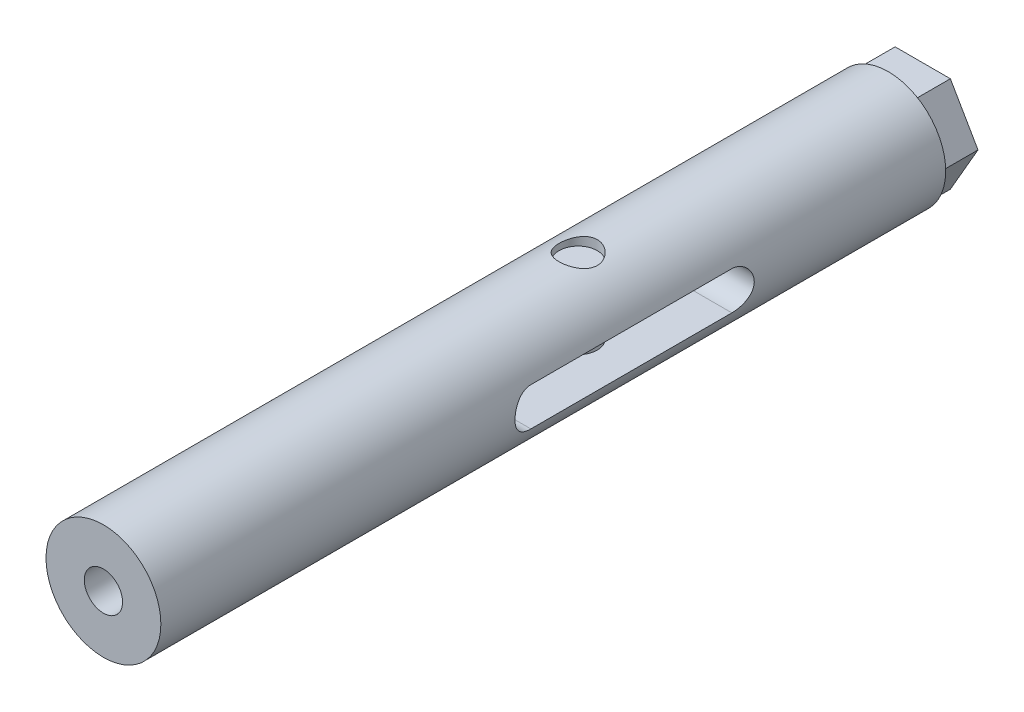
ISO-10303-21;
HEADER;
FILE_DESCRIPTION(('STEP AP214'),'2;1');
FILE_NAME('part.step','',(''),(''),'','','');
FILE_SCHEMA(('AUTOMOTIVE_DESIGN { 1 0 10303 214 1 1 1 1 }'));
ENDSEC;
DATA;
#1=APPLICATION_CONTEXT('core data for automotive mechanical design processes');
#2=APPLICATION_PROTOCOL_DEFINITION('international standard','automotive_design',2000,#1);
#3=PRODUCT_CONTEXT('',#1,'mechanical');
#4=PRODUCT('Part','Part','',(#3));
#5=PRODUCT_RELATED_PRODUCT_CATEGORY('part','',(#4));
#6=PRODUCT_DEFINITION_FORMATION('','',#4);
#7=PRODUCT_DEFINITION_CONTEXT('part definition',#1,'design');
#8=PRODUCT_DEFINITION('design','',#6,#7);
#9=PRODUCT_DEFINITION_SHAPE('','',#8);
#10=(LENGTH_UNIT() NAMED_UNIT(*) SI_UNIT(.MILLI.,.METRE.));
#11=(NAMED_UNIT(*) PLANE_ANGLE_UNIT() SI_UNIT($,.RADIAN.));
#12=(NAMED_UNIT(*) SI_UNIT($,.STERADIAN.) SOLID_ANGLE_UNIT());
#13=UNCERTAINTY_MEASURE_WITH_UNIT(LENGTH_MEASURE(1.E-05),#10,'distance_accuracy_value','');
#14=(GEOMETRIC_REPRESENTATION_CONTEXT(3) GLOBAL_UNCERTAINTY_ASSIGNED_CONTEXT((#13)) GLOBAL_UNIT_ASSIGNED_CONTEXT((#10,
#11,#12)) REPRESENTATION_CONTEXT('',''));
#15=CARTESIAN_POINT('',(0.,0.,0.));
#16=DIRECTION('',(0.,0.,1.));
#17=DIRECTION('',(1.,0.,0.));
#18=AXIS2_PLACEMENT_3D('',#15,#16,#17);
#19=CARTESIAN_POINT('',(0.,5.,36.));
#20=DIRECTION('',(0.,1.,0.));
#21=DIRECTION('',(0.354612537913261,0.,-0.935013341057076));
#22=AXIS2_PLACEMENT_3D('',#19,#20,#21);
#23=PLANE('',#22);
#24=CARTESIAN_POINT('',(0.,5.,36.));
#25=DIRECTION('',(0.,1.,0.));
#26=DIRECTION('',(0.354612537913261,0.,-0.935013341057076));
#27=AXIS2_PLACEMENT_3D('',#24,#25,#26);
#28=CIRCLE('',#27,2.);
#29=CARTESIAN_POINT('',(0.709225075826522,5.,34.1299733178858));
#30=VERTEX_POINT('',#29);
#31=EDGE_CURVE('E306',#30,#30,#28,.T.);
#32=ORIENTED_EDGE('',*,*,#31,.T.);
#33=EDGE_LOOP('',(#32));
#34=FACE_BOUND('',#33,.T.);
#35=ADVANCED_FACE('F14',(#34),#23,.T.);
#36=CARTESIAN_POINT('',(0.,5.,36.));
#37=DIRECTION('',(0.,-1.,0.));
#38=DIRECTION('',(-0.354612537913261,0.,0.935013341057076));
#39=AXIS2_PLACEMENT_3D('',#36,#37,#38);
#40=CYLINDRICAL_SURFACE('',#39,2.);
#41=CARTESIAN_POINT('',(0.,2.,36.));
#42=DIRECTION('',(0.,1.,0.));
#43=DIRECTION('',(1.,0.,0.));
#44=AXIS2_PLACEMENT_3D('',#41,#42,#43);
#45=CIRCLE('',#44,2.);
#46=CARTESIAN_POINT('',(2.,2.,36.));
#47=VERTEX_POINT('',#46);
#48=EDGE_CURVE('E24',#47,#47,#45,.T.);
#49=ORIENTED_EDGE('',*,*,#48,.F.);
#50=EDGE_LOOP('',(#49));
#51=FACE_BOUND('',#50,.T.);
#52=CARTESIAN_POINT('',(0.,-2.,36.));
#53=DIRECTION('',(0.,-1.,0.));
#54=DIRECTION('',(-1.,0.,0.));
#55=AXIS2_PLACEMENT_3D('',#52,#53,#54);
#56=CIRCLE('',#55,2.);
#57=CARTESIAN_POINT('',(-2.,-2.,36.));
#58=VERTEX_POINT('',#57);
#59=EDGE_CURVE('E9',#58,#58,#56,.T.);
#60=ORIENTED_EDGE('',*,*,#59,.F.);
#61=EDGE_LOOP('',(#60));
#62=FACE_BOUND('',#61,.T.);
#63=ADVANCED_FACE('F214',(#51,#62),#40,.T.);
#64=CARTESIAN_POINT('',(0.,-5.,36.));
#65=DIRECTION('',(0.,1.,0.));
#66=DIRECTION('',(0.354612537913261,0.,-0.935013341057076));
#67=AXIS2_PLACEMENT_3D('',#64,#65,#66);
#68=PLANE('',#67);
#69=CARTESIAN_POINT('',(0.,-5.,36.));
#70=DIRECTION('',(0.,1.,0.));
#71=DIRECTION('',(0.354612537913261,0.,-0.935013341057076));
#72=AXIS2_PLACEMENT_3D('',#69,#70,#71);
#73=CIRCLE('',#72,2.);
#74=CARTESIAN_POINT('',(0.709225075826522,-5.,34.1299733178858));
#75=VERTEX_POINT('',#74);
#76=EDGE_CURVE('E283',#75,#75,#73,.T.);
#77=ORIENTED_EDGE('',*,*,#76,.F.);
#78=EDGE_LOOP('',(#77));
#79=FACE_BOUND('',#78,.T.);
#80=ADVANCED_FACE('F202',(#79),#68,.F.);
#81=CARTESIAN_POINT('',(0.,0.,18.6));
#82=DIRECTION('',(0.,0.,-1.));
#83=DIRECTION('',(0.,1.,0.));
#84=AXIS2_PLACEMENT_3D('',#81,#82,#83);
#85=CONICAL_SURFACE('',#84,3.,1.02974425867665);
#86=CARTESIAN_POINT('',(0.,0.,20.4025818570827));
#87=VERTEX_POINT('',#86);
#88=VERTEX_LOOP('',#87);
#89=FACE_BOUND('',#88,.T.);
#90=CARTESIAN_POINT('',(0.,0.,18.6));
#91=DIRECTION('',(0.,0.,-1.));
#92=DIRECTION('',(0.,1.,0.));
#93=AXIS2_PLACEMENT_3D('',#90,#91,#92);
#94=CIRCLE('',#93,3.);
#95=CARTESIAN_POINT('',(0.,3.,18.6));
#96=VERTEX_POINT('',#95);
#97=EDGE_CURVE('E132',#96,#96,#94,.T.);
#98=ORIENTED_EDGE('',*,*,#97,.T.);
#99=EDGE_LOOP('',(#98));
#100=FACE_BOUND('',#99,.T.);
#101=ADVANCED_FACE('F213',(#89,#100),#85,.F.);
#102=CARTESIAN_POINT('',(0.,0.,3.6));
#103=DIRECTION('',(0.,0.,-1.));
#104=DIRECTION('',(0.,1.,0.));
#105=AXIS2_PLACEMENT_3D('',#102,#103,#104);
#106=CYLINDRICAL_SURFACE('',#105,3.);
#107=ORIENTED_EDGE('',*,*,#97,.F.);
#108=EDGE_LOOP('',(#107));
#109=FACE_BOUND('',#108,.T.);
#110=CARTESIAN_POINT('',(0.,0.,0.));
#111=DIRECTION('',(0.,0.,1.));
#112=DIRECTION('',(0.5,-0.866025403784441,0.));
#113=AXIS2_PLACEMENT_3D('',#110,#111,#112);
#114=CIRCLE('',#113,3.);
#115=CARTESIAN_POINT('',(1.5,-2.59807621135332,0.));
#116=VERTEX_POINT('',#115);
#117=EDGE_CURVE('E18',#116,#116,#114,.F.);
#118=ORIENTED_EDGE('',*,*,#117,.T.);
#119=EDGE_LOOP('',(#118));
#120=FACE_BOUND('',#119,.T.);
#121=ADVANCED_FACE('F227',(#109,#120),#106,.F.);
#122=CARTESIAN_POINT('',(-5.5769138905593,-10.3405017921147,0.));
#123=DIRECTION('',(0.,0.,1.));
#124=DIRECTION('',(0.5,-0.866025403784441,0.));
#125=AXIS2_PLACEMENT_3D('',#122,#123,#124);
#126=PLANE('',#125);
#127=DIRECTION('',(0.5,-0.866025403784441,0.));
#128=VECTOR('',#127,1.);
#129=CARTESIAN_POINT('',(5.77350269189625,0.,0.));
#130=LINE('',#129,#128);
#131=CARTESIAN_POINT('',(2.88675134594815,5.,0.));
#132=VERTEX_POINT('',#131);
#133=CARTESIAN_POINT('',(5.77350269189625,0.,0.));
#134=VERTEX_POINT('',#133);
#135=EDGE_CURVE('E54',#132,#134,#130,.T.);
#136=ORIENTED_EDGE('',*,*,#135,.T.);
#137=DIRECTION('',(0.5,0.866025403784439,0.));
#138=VECTOR('',#137,1.);
#139=CARTESIAN_POINT('',(5.77350269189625,0.,0.));
#140=LINE('',#139,#138);
#141=CARTESIAN_POINT('',(2.88675134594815,-5.,0.));
#142=VERTEX_POINT('',#141);
#143=EDGE_CURVE('E278',#142,#134,#140,.T.);
#144=ORIENTED_EDGE('',*,*,#143,.F.);
#145=DIRECTION('',(-1.,0.,0.));
#146=VECTOR('',#145,1.);
#147=CARTESIAN_POINT('',(-2.88675134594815,-5.,0.));
#148=LINE('',#147,#146);
#149=CARTESIAN_POINT('',(-2.88675134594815,-5.,0.));
#150=VERTEX_POINT('',#149);
#151=EDGE_CURVE('E276',#142,#150,#148,.T.);
#152=ORIENTED_EDGE('',*,*,#151,.T.);
#153=DIRECTION('',(0.5,-0.866025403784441,0.));
#154=VECTOR('',#153,1.);
#155=CARTESIAN_POINT('',(-2.88675134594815,-5.,0.));
#156=LINE('',#155,#154);
#157=CARTESIAN_POINT('',(-5.77350269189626,0.,0.));
#158=VERTEX_POINT('',#157);
#159=EDGE_CURVE('E274',#158,#150,#156,.T.);
#160=ORIENTED_EDGE('',*,*,#159,.F.);
#161=DIRECTION('',(-0.5,-0.866025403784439,0.));
#162=VECTOR('',#161,1.);
#163=CARTESIAN_POINT('',(-5.77350269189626,0.,0.));
#164=LINE('',#163,#162);
#165=CARTESIAN_POINT('',(-2.8867513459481,5.,0.));
#166=VERTEX_POINT('',#165);
#167=EDGE_CURVE('E59',#166,#158,#164,.T.);
#168=ORIENTED_EDGE('',*,*,#167,.F.);
#169=DIRECTION('',(1.,0.,0.));
#170=VECTOR('',#169,1.);
#171=CARTESIAN_POINT('',(2.88675134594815,5.,0.));
#172=LINE('',#171,#170);
#173=EDGE_CURVE('E271',#166,#132,#172,.T.);
#174=ORIENTED_EDGE('',*,*,#173,.T.);
#175=EDGE_LOOP('',(#136,#144,#152,#160,#168,#174));
#176=FACE_BOUND('',#175,.T.);
#177=ORIENTED_EDGE('',*,*,#117,.F.);
#178=EDGE_LOOP('',(#177));
#179=FACE_BOUND('',#178,.T.);
#180=ADVANCED_FACE('F223',(#176,#179),#126,.F.);
#181=CARTESIAN_POINT('',(-2.88675134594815,-5.,-1.4));
#182=DIRECTION('',(0.,-1.,0.));
#183=DIRECTION('',(-1.,0.,0.));
#184=AXIS2_PLACEMENT_3D('',#181,#182,#183);
#185=PLANE('',#184);
#186=ORIENTED_EDGE('',*,*,#151,.F.);
#187=DIRECTION('',(0.,0.,1.));
#188=VECTOR('',#187,1.);
#189=CARTESIAN_POINT('',(2.88675134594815,-5.,-1.4));
#190=LINE('',#189,#188);
#191=CARTESIAN_POINT('',(2.88675134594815,-5.,3.6));
#192=VERTEX_POINT('',#191);
#193=EDGE_CURVE('E123',#142,#192,#190,.T.);
#194=ORIENTED_EDGE('',*,*,#193,.T.);
#195=DIRECTION('',(1.,0.,0.));
#196=VECTOR('',#195,1.);
#197=CARTESIAN_POINT('',(-2.88675134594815,-5.,3.6));
#198=LINE('',#197,#196);
#199=CARTESIAN_POINT('',(-2.88675134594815,-5.,3.6));
#200=VERTEX_POINT('',#199);
#201=EDGE_CURVE('E118',#200,#192,#198,.T.);
#202=ORIENTED_EDGE('',*,*,#201,.F.);
#203=DIRECTION('',(0.,0.,1.));
#204=VECTOR('',#203,1.);
#205=CARTESIAN_POINT('',(-2.88675134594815,-5.,-1.4));
#206=LINE('',#205,#204);
#207=EDGE_CURVE('E117',#150,#200,#206,.T.);
#208=ORIENTED_EDGE('',*,*,#207,.F.);
#209=EDGE_LOOP('',(#186,#194,#202,#208));
#210=FACE_BOUND('',#209,.T.);
#211=ADVANCED_FACE('F292',(#210),#185,.T.);
#212=CARTESIAN_POINT('',(-2.88675134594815,-5.,-1.4));
#213=DIRECTION('',(0.86602540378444,0.5,0.));
#214=DIRECTION('',(0.,0.,-1.));
#215=AXIS2_PLACEMENT_3D('',#212,#213,#214);
#216=PLANE('',#215);
#217=DIRECTION('',(0.,0.,1.));
#218=VECTOR('',#217,1.);
#219=CARTESIAN_POINT('',(-5.77350269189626,0.,-1.4));
#220=LINE('',#219,#218);
#221=CARTESIAN_POINT('',(-5.77350269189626,0.,3.6));
#222=VERTEX_POINT('',#221);
#223=EDGE_CURVE('E115',#158,#222,#220,.T.);
#224=ORIENTED_EDGE('',*,*,#223,.F.);
#225=ORIENTED_EDGE('',*,*,#159,.T.);
#226=ORIENTED_EDGE('',*,*,#207,.T.);
#227=DIRECTION('',(-0.5,0.866025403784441,0.));
#228=VECTOR('',#227,1.);
#229=CARTESIAN_POINT('',(-2.88675134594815,-5.,3.6));
#230=LINE('',#229,#228);
#231=EDGE_CURVE('E104',#200,#222,#230,.T.);
#232=ORIENTED_EDGE('',*,*,#231,.T.);
#233=EDGE_LOOP('',(#224,#225,#226,#232));
#234=FACE_BOUND('',#233,.T.);
#235=ADVANCED_FACE('F113',(#234),#216,.F.);
#236=CARTESIAN_POINT('',(-5.77350269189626,0.,-1.4));
#237=DIRECTION('',(0.86602540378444,-0.5,0.));
#238=DIRECTION('',(-0.5,-0.866025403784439,0.));
#239=AXIS2_PLACEMENT_3D('',#236,#237,#238);
#240=PLANE('',#239);
#241=DIRECTION('',(0.,0.,1.));
#242=VECTOR('',#241,1.);
#243=CARTESIAN_POINT('',(-2.8867513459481,5.,-1.4));
#244=LINE('',#243,#242);
#245=CARTESIAN_POINT('',(-2.8867513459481,5.,3.6));
#246=VERTEX_POINT('',#245);
#247=EDGE_CURVE('E121',#166,#246,#244,.T.);
#248=ORIENTED_EDGE('',*,*,#247,.F.);
#249=ORIENTED_EDGE('',*,*,#167,.T.);
#250=ORIENTED_EDGE('',*,*,#223,.T.);
#251=DIRECTION('',(0.5,0.866025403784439,0.));
#252=VECTOR('',#251,1.);
#253=CARTESIAN_POINT('',(-5.77350269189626,0.,3.6));
#254=LINE('',#253,#252);
#255=EDGE_CURVE('E100',#222,#246,#254,.T.);
#256=ORIENTED_EDGE('',*,*,#255,.T.);
#257=EDGE_LOOP('',(#248,#249,#250,#256));
#258=FACE_BOUND('',#257,.T.);
#259=ADVANCED_FACE('F120',(#258),#240,.F.);
#260=CARTESIAN_POINT('',(2.88675134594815,5.,-1.4));
#261=DIRECTION('',(0.,1.,0.));
#262=DIRECTION('',(1.,0.,0.));
#263=AXIS2_PLACEMENT_3D('',#260,#261,#262);
#264=PLANE('',#263);
#265=ORIENTED_EDGE('',*,*,#173,.F.);
#266=ORIENTED_EDGE('',*,*,#247,.T.);
#267=DIRECTION('',(-1.,0.,0.));
#268=VECTOR('',#267,1.);
#269=CARTESIAN_POINT('',(2.88675134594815,5.,3.6));
#270=LINE('',#269,#268);
#271=CARTESIAN_POINT('',(2.88675134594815,5.,3.6));
#272=VERTEX_POINT('',#271);
#273=EDGE_CURVE('E33',#272,#246,#270,.T.);
#274=ORIENTED_EDGE('',*,*,#273,.F.);
#275=DIRECTION('',(0.,0.,1.));
#276=VECTOR('',#275,1.);
#277=CARTESIAN_POINT('',(2.88675134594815,5.,-1.4));
#278=LINE('',#277,#276);
#279=EDGE_CURVE('E125',#132,#272,#278,.T.);
#280=ORIENTED_EDGE('',*,*,#279,.F.);
#281=EDGE_LOOP('',(#265,#266,#274,#280));
#282=FACE_BOUND('',#281,.T.);
#283=ADVANCED_FACE('F289',(#282),#264,.T.);
#284=CARTESIAN_POINT('',(5.77350269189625,0.,-1.4));
#285=DIRECTION('',(0.86602540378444,0.5,0.));
#286=DIRECTION('',(0.,0.,-1.));
#287=AXIS2_PLACEMENT_3D('',#284,#285,#286);
#288=PLANE('',#287);
#289=ORIENTED_EDGE('',*,*,#135,.F.);
#290=ORIENTED_EDGE('',*,*,#279,.T.);
#291=DIRECTION('',(-0.5,0.866025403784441,0.));
#292=VECTOR('',#291,1.);
#293=CARTESIAN_POINT('',(5.77350269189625,0.,3.6));
#294=LINE('',#293,#292);
#295=CARTESIAN_POINT('',(5.77350269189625,0.,3.6));
#296=VERTEX_POINT('',#295);
#297=EDGE_CURVE('E281',#296,#272,#294,.T.);
#298=ORIENTED_EDGE('',*,*,#297,.F.);
#299=DIRECTION('',(0.,0.,1.));
#300=VECTOR('',#299,1.);
#301=CARTESIAN_POINT('',(5.77350269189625,0.,-1.4));
#302=LINE('',#301,#300);
#303=EDGE_CURVE('E130',#134,#296,#302,.T.);
#304=ORIENTED_EDGE('',*,*,#303,.F.);
#305=EDGE_LOOP('',(#289,#290,#298,#304));
#306=FACE_BOUND('',#305,.T.);
#307=ADVANCED_FACE('F234',(#306),#288,.T.);
#308=CARTESIAN_POINT('',(5.77350269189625,0.,-1.4));
#309=DIRECTION('',(-0.86602540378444,0.5,0.));
#310=DIRECTION('',(0.5,0.866025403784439,0.));
#311=AXIS2_PLACEMENT_3D('',#308,#309,#310);
#312=PLANE('',#311);
#313=ORIENTED_EDGE('',*,*,#193,.F.);
#314=ORIENTED_EDGE('',*,*,#143,.T.);
#315=ORIENTED_EDGE('',*,*,#303,.T.);
#316=DIRECTION('',(-0.5,-0.866025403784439,0.));
#317=VECTOR('',#316,1.);
#318=CARTESIAN_POINT('',(5.77350269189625,0.,3.6));
#319=LINE('',#318,#317);
#320=EDGE_CURVE('E270',#296,#192,#319,.T.);
#321=ORIENTED_EDGE('',*,*,#320,.T.);
#322=EDGE_LOOP('',(#313,#314,#315,#321));
#323=FACE_BOUND('',#322,.T.);
#324=ADVANCED_FACE('F16',(#323),#312,.F.);
#325=CARTESIAN_POINT('',(0.,0.,3.6));
#326=DIRECTION('',(0.,0.,1.));
#327=DIRECTION('',(0.,-1.,0.));
#328=AXIS2_PLACEMENT_3D('',#325,#326,#327);
#329=PLANE('',#328);
#330=ORIENTED_EDGE('',*,*,#320,.F.);
#331=ORIENTED_EDGE('',*,*,#297,.T.);
#332=ORIENTED_EDGE('',*,*,#273,.T.);
#333=ORIENTED_EDGE('',*,*,#255,.F.);
#334=ORIENTED_EDGE('',*,*,#231,.F.);
#335=ORIENTED_EDGE('',*,*,#201,.T.);
#336=EDGE_LOOP('',(#330,#331,#332,#333,#334,#335));
#337=FACE_BOUND('',#336,.T.);
#338=CARTESIAN_POINT('',(0.,0.,3.6));
#339=DIRECTION('',(0.,0.,-1.));
#340=DIRECTION('',(0.,1.,0.));
#341=AXIS2_PLACEMENT_3D('',#338,#339,#340);
#342=CIRCLE('',#341,6.);
#343=CARTESIAN_POINT('',(0.,6.,3.6));
#344=VERTEX_POINT('',#343);
#345=EDGE_CURVE('E142',#344,#344,#342,.T.);
#346=ORIENTED_EDGE('',*,*,#345,.T.);
#347=EDGE_LOOP('',(#346));
#348=FACE_BOUND('',#347,.T.);
#349=ADVANCED_FACE('F102',(#337,#348),#329,.F.);
#350=CARTESIAN_POINT('',(0.,0.,85.6));
#351=DIRECTION('',(0.,0.,-1.));
#352=DIRECTION('',(0.,1.,0.));
#353=AXIS2_PLACEMENT_3D('',#350,#351,#352);
#354=PLANE('',#353);
#355=CARTESIAN_POINT('',(0.,0.,85.6));
#356=DIRECTION('',(0.,0.,1.));
#357=DIRECTION('',(1.,0.,0.));
#358=AXIS2_PLACEMENT_3D('',#355,#356,#357);
#359=CIRCLE('',#358,2.);
#360=CARTESIAN_POINT('',(2.,0.,85.6));
#361=VERTEX_POINT('',#360);
#362=EDGE_CURVE('E299',#361,#361,#359,.T.);
#363=ORIENTED_EDGE('',*,*,#362,.F.);
#364=EDGE_LOOP('',(#363));
#365=FACE_BOUND('',#364,.T.);
#366=CARTESIAN_POINT('',(0.,0.,85.6));
#367=DIRECTION('',(0.,0.,1.));
#368=DIRECTION('',(0.,-1.,0.));
#369=AXIS2_PLACEMENT_3D('',#366,#367,#368);
#370=CIRCLE('',#369,6.);
#371=CARTESIAN_POINT('',(0.,-6.,85.6));
#372=VERTEX_POINT('',#371);
#373=EDGE_CURVE('E137',#372,#372,#370,.T.);
#374=ORIENTED_EDGE('',*,*,#373,.T.);
#375=EDGE_LOOP('',(#374));
#376=FACE_BOUND('',#375,.T.);
#377=ADVANCED_FACE('F198',(#365,#376),#354,.F.);
#378=CARTESIAN_POINT('',(-10.,0.,25.6));
#379=DIRECTION('',(1.,0.,0.));
#380=DIRECTION('',(0.,1.,0.));
#381=AXIS2_PLACEMENT_3D('',#378,#379,#380);
#382=CYLINDRICAL_SURFACE('',#381,2.);
#383=DIRECTION('',(1.,0.,0.));
#384=VECTOR('',#383,1.);
#385=CARTESIAN_POINT('',(-10.,2.,25.6));
#386=LINE('',#385,#384);
#387=CARTESIAN_POINT('',(-5.65685424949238,2.,25.6));
#388=VERTEX_POINT('',#387);
#389=CARTESIAN_POINT('',(5.6568542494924,2.,25.6));
#390=VERTEX_POINT('',#389);
#391=EDGE_CURVE('E148',#388,#390,#386,.T.);
#392=ORIENTED_EDGE('',*,*,#391,.F.);
#393=CARTESIAN_POINT('',(-5.65685424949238,-2.,25.6));
#394=CARTESIAN_POINT('',(-5.65684884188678,-2.0000014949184,25.5454190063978));
#395=CARTESIAN_POINT('',(-5.6576451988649,-1.99776424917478,25.4908658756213));
#396=CARTESIAN_POINT('',(-5.66078654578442,-1.9888512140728,25.3821828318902));
#397=CARTESIAN_POINT('',(-5.66313111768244,-1.98217662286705,25.3280528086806));
#398=CARTESIAN_POINT('',(-5.67238184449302,-1.95562135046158,25.1672157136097));
#399=CARTESIAN_POINT('',(-5.68150584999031,-1.92920846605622,25.0616383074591));
#400=CARTESIAN_POINT('',(-5.70456149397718,-1.85991682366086,24.8567496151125));
#401=CARTESIAN_POINT('',(-5.71849047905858,-1.81704715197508,24.7574349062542));
#402=CARTESIAN_POINT('',(-5.74957574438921,-1.71614645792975,24.5673203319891));
#403=CARTESIAN_POINT('',(-5.76673400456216,-1.65810612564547,24.4765257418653));
#404=CARTESIAN_POINT('',(-5.80308960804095,-1.52610278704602,24.302559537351));
#405=CARTESIAN_POINT('',(-5.82233755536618,-1.45164996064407,24.2197702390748));
#406=CARTESIAN_POINT('',(-5.86027697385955,-1.28997688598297,24.0675879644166));
#407=CARTESIAN_POINT('',(-5.87896834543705,-1.20275436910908,23.9981973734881));
#408=CARTESIAN_POINT('',(-5.91427765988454,-1.01520729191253,23.8730409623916));
#409=CARTESIAN_POINT('',(-5.93082875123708,-0.914600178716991,23.8176780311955));
#410=CARTESIAN_POINT('',(-5.95939217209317,-0.704858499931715,23.7248154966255));
#411=CARTESIAN_POINT('',(-5.97140588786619,-0.595726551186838,23.6873104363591));
#412=CARTESIAN_POINT('',(-5.98918142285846,-0.376058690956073,23.6325285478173));
#413=CARTESIAN_POINT('',(-5.99514617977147,-0.265703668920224,23.6145934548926));
#414=CARTESIAN_POINT('',(-6.00087216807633,-0.043397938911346,23.5973674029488));
#415=CARTESIAN_POINT('',(-6.00063487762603,0.0685523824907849,23.5980720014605));
#416=CARTESIAN_POINT('',(-5.9941207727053,0.286207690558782,23.6176885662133));
#417=CARTESIAN_POINT('',(-5.98808121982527,0.391985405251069,23.6358852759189));
#418=CARTESIAN_POINT('',(-5.97093921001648,0.59888812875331,23.6887863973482));
#419=CARTESIAN_POINT('',(-5.95983647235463,0.70001287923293,23.7234917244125));
#420=CARTESIAN_POINT('',(-5.93351336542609,0.896305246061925,23.8088427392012));
#421=CARTESIAN_POINT('',(-5.91824075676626,0.991377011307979,23.8596920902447));
#422=CARTESIAN_POINT('',(-5.88516775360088,1.17184917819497,23.9757199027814));
#423=CARTESIAN_POINT('',(-5.86736667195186,1.25724693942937,24.040902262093));
#424=CARTESIAN_POINT('',(-5.83012543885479,1.42019467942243,24.1873420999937));
#425=CARTESIAN_POINT('',(-5.81064757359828,1.4971872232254,24.2692110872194));
#426=CARTESIAN_POINT('',(-5.77294980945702,1.63654404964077,24.4448829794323));
#427=CARTESIAN_POINT('',(-5.75473031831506,1.69890360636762,24.5386897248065));
#428=CARTESIAN_POINT('',(-5.72140062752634,1.80800665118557,24.7373603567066));
#429=CARTESIAN_POINT('',(-5.70634029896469,1.85450601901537,24.8423670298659));
#430=CARTESIAN_POINT('',(-5.68162194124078,1.92892046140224,25.0592939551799));
#431=CARTESIAN_POINT('',(-5.67195538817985,1.95686487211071,25.1712029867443));
#432=CARTESIAN_POINT('',(-5.66273084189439,1.98331631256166,25.336837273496));
#433=CARTESIAN_POINT('',(-5.66053335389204,1.98957012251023,25.3892827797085));
#434=CARTESIAN_POINT('',(-5.65759407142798,1.9979092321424,25.4944761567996));
#435=CARTESIAN_POINT('',(-5.65685039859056,1.99999991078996,25.5472235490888));
#436=CARTESIAN_POINT('',(-5.65685424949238,2.,25.6));
#437=B_SPLINE_CURVE_WITH_KNOTS('',3,(#393,#394,#395,#396,#397,#398,#399,#400,#401,#402,#403,
#404,#405,#406,#407,#408,#409,#410,#411,#412,#413,#414,#415,#416,#417,#418,#419,#420,#421,#422,
#423,#424,#425,#426,#427,#428,#429,#430,#431,#432,#433,#434,#435,#436),.UNSPECIFIED.,.F.,.F.,(4,
2,2,2,2,2,2,2,2,2,2,2,2,2,2,2,2,2,2,2,2,4),(0.,0.16363696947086,0.327229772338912,
0.653162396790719,0.978915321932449,1.3048686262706,1.64233009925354,1.97985159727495,
2.32618265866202,2.67240782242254,3.00658941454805,3.34069136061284,3.66168836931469,
3.98270317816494,4.30794037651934,4.63326613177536,4.97388108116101,5.31460588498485,
5.66036059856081,6.00556734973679,6.16399790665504,6.32222363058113),.UNSPECIFIED.);
#438=CARTESIAN_POINT('',(-5.65685424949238,-2.,25.6));
#439=VERTEX_POINT('',#438);
#440=EDGE_CURVE('E259',#439,#388,#437,.T.);
#441=ORIENTED_EDGE('',*,*,#440,.F.);
#442=DIRECTION('',(1.,0.,0.));
#443=VECTOR('',#442,1.);
#444=CARTESIAN_POINT('',(-10.,-2.,25.6));
#445=LINE('',#444,#443);
#446=CARTESIAN_POINT('',(5.6568542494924,-2.,25.6));
#447=VERTEX_POINT('',#446);
#448=EDGE_CURVE('E149',#439,#447,#445,.T.);
#449=ORIENTED_EDGE('',*,*,#448,.T.);
#450=CARTESIAN_POINT('',(5.6568542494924,2.,25.6));
#451=CARTESIAN_POINT('',(5.65684884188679,2.0000014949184,25.5454190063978));
#452=CARTESIAN_POINT('',(5.6576451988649,1.99776424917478,25.4908658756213));
#453=CARTESIAN_POINT('',(5.66078654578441,1.9888512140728,25.3821828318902));
#454=CARTESIAN_POINT('',(5.66313111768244,1.98217662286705,25.3280528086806));
#455=CARTESIAN_POINT('',(5.67238184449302,1.95562135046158,25.1672157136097));
#456=CARTESIAN_POINT('',(5.68150584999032,1.92920846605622,25.0616383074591));
#457=CARTESIAN_POINT('',(5.70456149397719,1.85991682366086,24.8567496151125));
#458=CARTESIAN_POINT('',(5.71849047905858,1.81704715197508,24.7574349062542));
#459=CARTESIAN_POINT('',(5.74957574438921,1.71614645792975,24.5673203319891));
#460=CARTESIAN_POINT('',(5.76673400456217,1.65810612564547,24.4765257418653));
#461=CARTESIAN_POINT('',(5.80308960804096,1.52610278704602,24.302559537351));
#462=CARTESIAN_POINT('',(5.82233755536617,1.45164996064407,24.2197702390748));
#463=CARTESIAN_POINT('',(5.86027697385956,1.28997688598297,24.0675879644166));
#464=CARTESIAN_POINT('',(5.87896834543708,1.20275436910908,23.9981973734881));
#465=CARTESIAN_POINT('',(5.91427765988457,1.01520729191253,23.8730409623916));
#466=CARTESIAN_POINT('',(5.93082875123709,0.914600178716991,23.8176780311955));
#467=CARTESIAN_POINT('',(5.95939217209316,0.704858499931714,23.7248154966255));
#468=CARTESIAN_POINT('',(5.97140588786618,0.595726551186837,23.6873104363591));
#469=CARTESIAN_POINT('',(5.98918142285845,0.376058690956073,23.6325285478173));
#470=CARTESIAN_POINT('',(5.99514617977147,0.265703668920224,23.6145934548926));
#471=CARTESIAN_POINT('',(6.00087216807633,0.043397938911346,23.5973674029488));
#472=CARTESIAN_POINT('',(6.00063487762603,-0.0685523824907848,23.5980720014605));
#473=CARTESIAN_POINT('',(5.9941207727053,-0.286207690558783,23.6176885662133));
#474=CARTESIAN_POINT('',(5.98808121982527,-0.391985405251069,23.6358852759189));
#475=CARTESIAN_POINT('',(5.97093921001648,-0.59888812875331,23.6887863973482));
#476=CARTESIAN_POINT('',(5.95983647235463,-0.700012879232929,23.7234917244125));
#477=CARTESIAN_POINT('',(5.93351336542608,-0.896305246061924,23.8088427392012));
#478=CARTESIAN_POINT('',(5.91824075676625,-0.991377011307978,23.8596920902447));
#479=CARTESIAN_POINT('',(5.88516775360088,-1.17184917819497,23.9757199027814));
#480=CARTESIAN_POINT('',(5.86736667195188,-1.25724693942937,24.040902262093));
#481=CARTESIAN_POINT('',(5.83012543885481,-1.42019467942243,24.1873420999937));
#482=CARTESIAN_POINT('',(5.81064757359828,-1.4971872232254,24.2692110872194));
#483=CARTESIAN_POINT('',(5.77294980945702,-1.63654404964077,24.4448829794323));
#484=CARTESIAN_POINT('',(5.75473031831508,-1.69890360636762,24.5386897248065));
#485=CARTESIAN_POINT('',(5.72140062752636,-1.80800665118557,24.7373603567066));
#486=CARTESIAN_POINT('',(5.70634029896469,-1.85450601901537,24.8423670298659));
#487=CARTESIAN_POINT('',(5.68162194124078,-1.92892046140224,25.0592939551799));
#488=CARTESIAN_POINT('',(5.67195538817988,-1.95686487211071,25.1712029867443));
#489=CARTESIAN_POINT('',(5.66273084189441,-1.98331631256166,25.336837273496));
#490=CARTESIAN_POINT('',(5.66053335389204,-1.98957012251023,25.3892827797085));
#491=CARTESIAN_POINT('',(5.65759407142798,-1.9979092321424,25.4944761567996));
#492=CARTESIAN_POINT('',(5.65685039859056,-1.99999991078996,25.5472235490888));
#493=CARTESIAN_POINT('',(5.6568542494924,-2.,25.6));
#494=B_SPLINE_CURVE_WITH_KNOTS('',3,(#450,#451,#452,#453,#454,#455,#456,#457,#458,#459,#460,
#461,#462,#463,#464,#465,#466,#467,#468,#469,#470,#471,#472,#473,#474,#475,#476,#477,#478,#479,
#480,#481,#482,#483,#484,#485,#486,#487,#488,#489,#490,#491,#492,#493),.UNSPECIFIED.,.F.,.F.,(4,
2,2,2,2,2,2,2,2,2,2,2,2,2,2,2,2,2,2,2,2,4),(0.,0.16363696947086,0.327229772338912,
0.653162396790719,0.978915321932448,1.3048686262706,1.64233009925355,1.97985159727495,
2.32618265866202,2.67240782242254,3.00658941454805,3.34069136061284,3.66168836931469,
3.98270317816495,4.30794037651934,4.63326613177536,4.973881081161,5.31460588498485,
5.66036059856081,6.00556734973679,6.16399790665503,6.32222363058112),.UNSPECIFIED.);
#495=EDGE_CURVE('E258',#390,#447,#494,.T.);
#496=ORIENTED_EDGE('',*,*,#495,.F.);
#497=EDGE_LOOP('',(#392,#441,#449,#496));
#498=FACE_BOUND('',#497,.T.);
#499=ADVANCED_FACE('F195',(#498),#382,.F.);
#500=CARTESIAN_POINT('',(0.,0.,3.6));
#501=DIRECTION('',(0.,0.,-1.));
#502=DIRECTION('',(0.,1.,0.));
#503=AXIS2_PLACEMENT_3D('',#500,#501,#502);
#504=CYLINDRICAL_SURFACE('',#503,6.);
#505=ORIENTED_EDGE('',*,*,#373,.F.);
#506=EDGE_LOOP('',(#505));
#507=FACE_BOUND('',#506,.T.);
#508=DIRECTION('',(0.,0.,-1.));
#509=VECTOR('',#508,1.);
#510=CARTESIAN_POINT('',(5.6568542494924,2.,3.6));
#511=LINE('',#510,#509);
#512=CARTESIAN_POINT('',(5.6568542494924,2.,46.6));
#513=VERTEX_POINT('',#512);
#514=EDGE_CURVE('E162',#513,#390,#511,.T.);
#515=ORIENTED_EDGE('',*,*,#514,.T.);
#516=ORIENTED_EDGE('',*,*,#495,.T.);
#517=DIRECTION('',(0.,0.,-1.));
#518=VECTOR('',#517,1.);
#519=CARTESIAN_POINT('',(5.6568542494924,-2.,3.6));
#520=LINE('',#519,#518);
#521=CARTESIAN_POINT('',(5.6568542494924,-2.,46.6));
#522=VERTEX_POINT('',#521);
#523=EDGE_CURVE('E165',#447,#522,#520,.F.);
#524=ORIENTED_EDGE('',*,*,#523,.T.);
#525=CARTESIAN_POINT('',(5.6568542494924,2.,46.6));
#526=CARTESIAN_POINT('',(5.6568538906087,2.00000051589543,46.4910636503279));
#527=CARTESIAN_POINT('',(5.66003538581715,1.99106956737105,46.3821304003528));
#528=CARTESIAN_POINT('',(5.67235148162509,1.95570226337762,46.1674911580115));
#529=CARTESIAN_POINT('',(5.68148706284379,1.92926302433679,46.0617857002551));
#530=CARTESIAN_POINT('',(5.70456407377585,1.85991097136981,45.8567462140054));
#531=CARTESIAN_POINT('',(5.71849607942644,1.81703044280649,45.7574001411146));
#532=CARTESIAN_POINT('',(5.74958244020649,1.71612325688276,45.5672799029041));
#533=CARTESIAN_POINT('',(5.76673750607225,1.65809325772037,45.4765076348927));
#534=CARTESIAN_POINT('',(5.80308978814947,1.52610229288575,45.3025600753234));
#535=CARTESIAN_POINT('',(5.82233789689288,1.45164868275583,45.2197691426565));
#536=CARTESIAN_POINT('',(5.86027729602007,1.28997533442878,45.0675863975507));
#537=CARTESIAN_POINT('',(5.87896849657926,1.20275355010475,44.9981967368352));
#538=CARTESIAN_POINT('',(5.914277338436,1.01520901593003,44.8730422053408));
#539=CARTESIAN_POINT('',(5.93082815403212,0.914603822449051,44.8176800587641));
#540=CARTESIAN_POINT('',(5.95939173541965,0.704862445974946,44.724816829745));
#541=CARTESIAN_POINT('',(5.97140572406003,0.595728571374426,44.6873109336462));
#542=CARTESIAN_POINT('',(5.98918150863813,0.376057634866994,44.6325282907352));
#543=CARTESIAN_POINT('',(5.99514629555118,0.265701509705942,44.614593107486));
#544=CARTESIAN_POINT('',(6.00087216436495,0.0433957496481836,44.5973674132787));
#545=CARTESIAN_POINT('',(6.00063484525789,-0.0685534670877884,44.5980720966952));
#546=CARTESIAN_POINT('',(5.99412079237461,-0.286207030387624,44.6176885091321));
#547=CARTESIAN_POINT('',(5.98808129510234,-0.391984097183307,44.635885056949));
#548=CARTESIAN_POINT('',(5.97093934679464,-0.598886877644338,44.6887859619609));
#549=CARTESIAN_POINT('',(5.95983655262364,-0.700012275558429,44.7234914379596));
#550=CARTESIAN_POINT('',(5.93351340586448,-0.896304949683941,44.8088426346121));
#551=CARTESIAN_POINT('',(5.91824085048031,-0.991376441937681,44.859691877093));
#552=CARTESIAN_POINT('',(5.88516786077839,-1.17184865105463,44.9757194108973));
#553=CARTESIAN_POINT('',(5.86736672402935,-1.25724666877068,45.0409016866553));
#554=CARTESIAN_POINT('',(5.83012383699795,-1.42020173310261,45.1873487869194));
#555=CARTESIAN_POINT('',(5.81064430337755,-1.49720031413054,45.269226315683));
#556=CARTESIAN_POINT('',(5.77294670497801,-1.63655451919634,45.4448974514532));
#557=CARTESIAN_POINT('',(5.75472883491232,-1.69890788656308,45.5386928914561));
#558=CARTESIAN_POINT('',(5.72141050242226,-1.80797491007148,45.7373072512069));
#559=CARTESIAN_POINT('',(5.70635818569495,-1.85445292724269,45.8422642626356));
#560=CARTESIAN_POINT('',(5.68163301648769,-1.92888638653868,46.0591427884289));
#561=CARTESIAN_POINT('',(5.67195790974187,-1.95684959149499,46.1710613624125));
#562=CARTESIAN_POINT('',(5.65959272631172,-1.99232256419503,46.3932767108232));
#563=CARTESIAN_POINT('',(5.65660720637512,-2.00069819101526,46.5034188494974));
#564=CARTESIAN_POINT('',(5.65713344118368,-1.99921087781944,46.7235522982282));
#565=CARTESIAN_POINT('',(5.66064401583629,-1.98935125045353,46.833543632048));
#566=CARTESIAN_POINT('',(5.67347236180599,-1.95245130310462,47.0463139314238));
#567=CARTESIAN_POINT('',(5.68258650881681,-1.92601278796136,47.1492108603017));
#568=CARTESIAN_POINT('',(5.70537107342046,-1.85742772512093,47.3490872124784));
#569=CARTESIAN_POINT('',(5.7190422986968,-1.81527839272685,47.4460655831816));
#570=CARTESIAN_POINT('',(5.74993755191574,-1.71494868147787,47.634760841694));
#571=CARTESIAN_POINT('',(5.76726051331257,-1.65630223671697,47.7262132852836));
#572=CARTESIAN_POINT('',(5.80331537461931,-1.5251712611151,47.8982921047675));
#573=CARTESIAN_POINT('',(5.82204768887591,-1.45268265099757,47.9789152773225));
#574=CARTESIAN_POINT('',(5.859900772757,-1.29178341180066,48.1310559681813));
#575=CARTESIAN_POINT('',(5.87899687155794,-1.20277454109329,48.2019487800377));
#576=CARTESIAN_POINT('',(5.91453703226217,-1.0136545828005,48.3278322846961));
#577=CARTESIAN_POINT('',(5.93098118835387,-0.913543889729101,48.3828235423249));
#578=CARTESIAN_POINT('',(5.95928811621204,-0.705559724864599,48.4748402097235));
#579=CARTESIAN_POINT('',(5.97118060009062,-0.597742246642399,48.5119825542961));
#580=CARTESIAN_POINT('',(5.98917221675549,-0.376916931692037,48.5674554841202));
#581=CARTESIAN_POINT('',(5.99527344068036,-0.263910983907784,48.585792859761));
#582=CARTESIAN_POINT('',(6.00083726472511,-0.0416306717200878,48.6025241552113));
#583=CARTESIAN_POINT('',(6.00059840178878,0.0675694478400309,48.6018149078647));
#584=CARTESIAN_POINT('',(5.99424393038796,0.284222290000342,48.5826853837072));
#585=CARTESIAN_POINT('',(5.98812879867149,0.391675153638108,48.5642665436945));
#586=CARTESIAN_POINT('',(5.97081829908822,0.600084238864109,48.5108355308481));
#587=CARTESIAN_POINT('',(5.95970516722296,0.701116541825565,48.4760915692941));
#588=CARTESIAN_POINT('',(5.93354321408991,0.89595670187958,48.3912449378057));
#589=CARTESIAN_POINT('',(5.91849368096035,0.98976324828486,48.341139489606));
#590=CARTESIAN_POINT('',(5.88531737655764,1.17126803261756,48.224860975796));
#591=CARTESIAN_POINT('',(5.86709744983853,1.25861250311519,48.1581626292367));
#592=CARTESIAN_POINT('',(5.8298597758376,1.42116205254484,48.0114852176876));
#593=CARTESIAN_POINT('',(5.81084177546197,1.49636324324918,47.9315019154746));
#594=CARTESIAN_POINT('',(5.773265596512,1.63548361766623,47.7567812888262));
#595=CARTESIAN_POINT('',(5.75475455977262,1.69884593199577,47.6615889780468));
#596=CARTESIAN_POINT('',(5.72120386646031,1.8086286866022,47.4613311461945));
#597=CARTESIAN_POINT('',(5.706163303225,1.85505355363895,47.3562682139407));
#598=CARTESIAN_POINT('',(5.6820266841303,1.92768765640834,47.1440763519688));
#599=CARTESIAN_POINT('',(5.67269265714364,1.95471581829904,47.0372554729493));
#600=CARTESIAN_POINT('',(5.66010767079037,1.99086864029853,46.8202878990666));
#601=CARTESIAN_POINT('',(5.65685461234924,1.99999947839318,46.7101423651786));
#602=CARTESIAN_POINT('',(5.6568542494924,2.,46.6));
#603=B_SPLINE_CURVE_WITH_KNOTS('',3,(#525,#526,#527,#528,#529,#530,#531,#532,#533,#534,#535,
#536,#537,#538,#539,#540,#541,#542,#543,#544,#545,#546,#547,#548,#549,#550,#551,#552,#553,#554,
#555,#556,#557,#558,#559,#560,#561,#562,#563,#564,#565,#566,#567,#568,#569,#570,#571,#572,#573,
#574,#575,#576,#577,#578,#579,#580,#581,#582,#583,#584,#585,#586,#587,#588,#589,#590,#591,#592,
#593,#594,#595,#596,#597,#598,#599,#600,#601,#602),.UNSPECIFIED.,.T.,.F.,(4,2,2,2,2,2,2,2,2,2,2,
2,2,2,2,2,2,2,2,2,2,2,2,2,2,2,2,2,2,2,2,2,2,2,2,2,2,2,4),(0.,0.326401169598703,
0.652856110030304,0.978673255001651,1.3045623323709,1.64202674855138,1.97954530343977,
2.32587012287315,2.67210152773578,3.00628637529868,3.34038506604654,3.66138009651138,
3.98239688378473,4.30763309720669,4.63295983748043,4.97360348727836,5.31429959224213,
5.65985279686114,6.00526102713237,6.33508582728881,6.66485071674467,6.98328791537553,
7.30178158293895,7.63037715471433,7.95906971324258,8.30357616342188,8.64807037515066,
8.99027582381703,9.33235766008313,9.65836169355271,9.98433928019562,10.3051391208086,
10.6259970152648,10.9587103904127,11.2915300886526,11.6373780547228,11.9831355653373,
12.3132642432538,12.6432789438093),.UNSPECIFIED.);
#604=EDGE_CURVE('E252',#522,#513,#603,.T.);
#605=ORIENTED_EDGE('',*,*,#604,.T.);
#606=EDGE_LOOP('',(#515,#516,#524,#605));
#607=FACE_BOUND('',#606,.T.);
#608=DIRECTION('',(0.,0.,-1.));
#609=VECTOR('',#608,1.);
#610=CARTESIAN_POINT('',(-5.65685424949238,-2.,3.6));
#611=LINE('',#610,#609);
#612=CARTESIAN_POINT('',(-5.65685424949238,-2.,46.6));
#613=VERTEX_POINT('',#612);
#614=EDGE_CURVE('E168',#613,#439,#611,.T.);
#615=ORIENTED_EDGE('',*,*,#614,.T.);
#616=ORIENTED_EDGE('',*,*,#440,.T.);
#617=DIRECTION('',(0.,0.,-1.));
#618=VECTOR('',#617,1.);
#619=CARTESIAN_POINT('',(-5.65685424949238,2.,3.6));
#620=LINE('',#619,#618);
#621=CARTESIAN_POINT('',(-5.65685424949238,2.,46.6));
#622=VERTEX_POINT('',#621);
#623=EDGE_CURVE('E152',#388,#622,#620,.F.);
#624=ORIENTED_EDGE('',*,*,#623,.T.);
#625=CARTESIAN_POINT('',(-5.65685424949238,2.,46.6));
#626=CARTESIAN_POINT('',(-5.65685389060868,2.00000051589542,46.7089363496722));
#627=CARTESIAN_POINT('',(-5.66003538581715,1.99106956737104,46.8178695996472));
#628=CARTESIAN_POINT('',(-5.6723514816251,1.95570226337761,47.0325088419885));
#629=CARTESIAN_POINT('',(-5.68148706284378,1.9292630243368,47.138214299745));
#630=CARTESIAN_POINT('',(-5.70456407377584,1.85991097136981,47.3432537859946));
#631=CARTESIAN_POINT('',(-5.71849607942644,1.81703044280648,47.4425998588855));
#632=CARTESIAN_POINT('',(-5.7495824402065,1.71612325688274,47.632720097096));
#633=CARTESIAN_POINT('',(-5.76673750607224,1.65809325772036,47.7234923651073));
#634=CARTESIAN_POINT('',(-5.80308978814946,1.52610229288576,47.8974399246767));
#635=CARTESIAN_POINT('',(-5.82233789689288,1.45164868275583,47.9802308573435));
#636=CARTESIAN_POINT('',(-5.86027729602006,1.28997533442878,48.1324136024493));
#637=CARTESIAN_POINT('',(-5.87896849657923,1.20275355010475,48.2018032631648));
#638=CARTESIAN_POINT('',(-5.91427733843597,1.01520901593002,48.3269577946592));
#639=CARTESIAN_POINT('',(-5.93082815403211,0.914603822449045,48.3823199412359));
#640=CARTESIAN_POINT('',(-5.95939173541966,0.704862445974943,48.475183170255));
#641=CARTESIAN_POINT('',(-5.97140572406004,0.595728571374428,48.5126890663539));
#642=CARTESIAN_POINT('',(-5.98918150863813,0.376057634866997,48.5674717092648));
#643=CARTESIAN_POINT('',(-5.99514629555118,0.26570150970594,48.585406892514));
#644=CARTESIAN_POINT('',(-6.00087216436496,0.0433957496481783,48.6026325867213));
#645=CARTESIAN_POINT('',(-6.00063484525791,-0.0685534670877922,48.6019279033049));
#646=CARTESIAN_POINT('',(-5.99412079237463,-0.286207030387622,48.582311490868));
#647=CARTESIAN_POINT('',(-5.98808129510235,-0.391984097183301,48.564114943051));
#648=CARTESIAN_POINT('',(-5.97093934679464,-0.598886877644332,48.5112140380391));
#649=CARTESIAN_POINT('',(-5.95983655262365,-0.700012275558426,48.4765085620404));
#650=CARTESIAN_POINT('',(-5.9335134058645,-0.896304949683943,48.3911573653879));
#651=CARTESIAN_POINT('',(-5.91824085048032,-0.991376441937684,48.340308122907));
#652=CARTESIAN_POINT('',(-5.88516786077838,-1.17184865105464,48.2242805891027));
#653=CARTESIAN_POINT('',(-5.86736672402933,-1.25724666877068,48.1590983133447));
#654=CARTESIAN_POINT('',(-5.83012383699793,-1.42020173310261,48.0126512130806));
#655=CARTESIAN_POINT('',(-5.81064430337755,-1.49720031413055,47.930773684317));
#656=CARTESIAN_POINT('',(-5.77294670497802,-1.63655451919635,47.7551025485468));
#657=CARTESIAN_POINT('',(-5.75472883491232,-1.69890788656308,47.6613071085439));
#658=CARTESIAN_POINT('',(-5.72141050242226,-1.80797491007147,47.4626927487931));
#659=CARTESIAN_POINT('',(-5.70635818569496,-1.85445292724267,47.3577357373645));
#660=CARTESIAN_POINT('',(-5.6816330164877,-1.92888638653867,47.1408572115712));
#661=CARTESIAN_POINT('',(-5.67195790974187,-1.95684959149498,47.0289386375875));
#662=CARTESIAN_POINT('',(-5.65959272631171,-1.99232256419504,46.8067232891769));
#663=CARTESIAN_POINT('',(-5.65660720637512,-2.00069819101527,46.6965811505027));
#664=CARTESIAN_POINT('',(-5.65713344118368,-1.99921087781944,46.4764477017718));
#665=CARTESIAN_POINT('',(-5.66064401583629,-1.98935125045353,46.366456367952));
#666=CARTESIAN_POINT('',(-5.67347236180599,-1.95245130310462,46.1536860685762));
#667=CARTESIAN_POINT('',(-5.6825865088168,-1.92601278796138,46.0507891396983));
#668=CARTESIAN_POINT('',(-5.70537107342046,-1.85742772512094,45.8509127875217));
#669=CARTESIAN_POINT('',(-5.7190422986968,-1.81527839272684,45.7539344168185));
#670=CARTESIAN_POINT('',(-5.74993755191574,-1.71494868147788,45.5652391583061));
#671=CARTESIAN_POINT('',(-5.76726051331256,-1.65630223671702,45.4737867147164));
#672=CARTESIAN_POINT('',(-5.8033153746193,-1.52517126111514,45.3017078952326));
#673=CARTESIAN_POINT('',(-5.8220476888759,-1.45268265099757,45.2210847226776));
#674=CARTESIAN_POINT('',(-5.85990077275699,-1.29178341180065,45.0689440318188));
#675=CARTESIAN_POINT('',(-5.87899687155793,-1.20277454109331,44.9980512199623));
#676=CARTESIAN_POINT('',(-5.91453703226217,-1.01365458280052,44.8721677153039));
#677=CARTESIAN_POINT('',(-5.93098118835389,-0.913543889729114,44.8171764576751));
#678=CARTESIAN_POINT('',(-5.95928811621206,-0.705559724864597,44.7251597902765));
#679=CARTESIAN_POINT('',(-5.97118060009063,-0.597742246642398,44.6880174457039));
#680=CARTESIAN_POINT('',(-5.98917221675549,-0.376916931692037,44.6325445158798));
#681=CARTESIAN_POINT('',(-5.99527344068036,-0.263910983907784,44.614207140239));
#682=CARTESIAN_POINT('',(-6.00083726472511,-0.0416306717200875,44.5974758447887));
#683=CARTESIAN_POINT('',(-6.00059840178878,0.0675694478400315,44.5981850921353));
#684=CARTESIAN_POINT('',(-5.99424393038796,0.284222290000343,44.6173146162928));
#685=CARTESIAN_POINT('',(-5.98812879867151,0.391675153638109,44.6357334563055));
#686=CARTESIAN_POINT('',(-5.97081829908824,0.60008423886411,44.6891644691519));
#687=CARTESIAN_POINT('',(-5.95970516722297,0.701116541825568,44.7239084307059));
#688=CARTESIAN_POINT('',(-5.9335432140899,0.895956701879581,44.8087550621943));
#689=CARTESIAN_POINT('',(-5.91849368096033,0.989763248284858,44.858860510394));
#690=CARTESIAN_POINT('',(-5.88531737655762,1.17126803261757,44.975139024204));
#691=CARTESIAN_POINT('',(-5.86709744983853,1.25861250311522,45.0418373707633));
#692=CARTESIAN_POINT('',(-5.82985977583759,1.42116205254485,45.1885147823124));
#693=CARTESIAN_POINT('',(-5.81084177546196,1.49636324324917,45.2684980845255));
#694=CARTESIAN_POINT('',(-5.77326559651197,1.63548361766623,45.443218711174));
#695=CARTESIAN_POINT('',(-5.75475455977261,1.69884593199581,45.5384110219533));
#696=CARTESIAN_POINT('',(-5.7212038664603,1.80862868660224,45.7386688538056));
#697=CARTESIAN_POINT('',(-5.706163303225,1.85505355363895,45.8437317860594));
#698=CARTESIAN_POINT('',(-5.6820266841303,1.92768765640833,46.0559236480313));
#699=CARTESIAN_POINT('',(-5.67269265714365,1.95471581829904,46.1627445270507));
#700=CARTESIAN_POINT('',(-5.66010767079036,1.99086864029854,46.3797121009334));
#701=CARTESIAN_POINT('',(-5.65685461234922,1.99999947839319,46.4898576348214));
#702=CARTESIAN_POINT('',(-5.65685424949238,2.,46.6));
#703=B_SPLINE_CURVE_WITH_KNOTS('',3,(#625,#626,#627,#628,#629,#630,#631,#632,#633,#634,#635,
#636,#637,#638,#639,#640,#641,#642,#643,#644,#645,#646,#647,#648,#649,#650,#651,#652,#653,#654,
#655,#656,#657,#658,#659,#660,#661,#662,#663,#664,#665,#666,#667,#668,#669,#670,#671,#672,#673,
#674,#675,#676,#677,#678,#679,#680,#681,#682,#683,#684,#685,#686,#687,#688,#689,#690,#691,#692,
#693,#694,#695,#696,#697,#698,#699,#700,#701,#702),.UNSPECIFIED.,.T.,.F.,(4,2,2,2,2,2,2,2,2,2,2,
2,2,2,2,2,2,2,2,2,2,2,2,2,2,2,2,2,2,2,2,2,2,2,2,2,2,2,4),(0.,0.326401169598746,
0.652856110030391,0.978673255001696,1.30456233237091,1.64202674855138,1.97954530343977,
2.32587012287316,2.6721015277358,3.0062863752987,3.34038506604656,3.66138009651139,
3.98239688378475,4.30763309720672,4.63295983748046,4.97360348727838,5.31429959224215,
5.65985279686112,6.00526102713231,6.3350858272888,6.6648507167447,6.98328791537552,
7.30178158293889,7.63037715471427,7.95906971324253,8.30357616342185,8.64807037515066,
8.99027582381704,9.33235766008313,9.65836169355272,9.98433928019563,10.3051391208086,
10.6259970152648,10.9587103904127,11.2915300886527,11.6373780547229,11.9831355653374,
12.3132642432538,12.6432789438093),.UNSPECIFIED.);
#704=EDGE_CURVE('E246',#622,#613,#703,.T.);
#705=ORIENTED_EDGE('',*,*,#704,.T.);
#706=EDGE_LOOP('',(#615,#616,#624,#705));
#707=FACE_BOUND('',#706,.T.);
#708=CARTESIAN_POINT('',(0.,6.,38.));
#709=CARTESIAN_POINT('',(-0.109126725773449,6.00000030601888,38.0000005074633));
#710=CARTESIAN_POINT('',(-0.218250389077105,5.99699539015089,37.9910394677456));
#711=CARTESIAN_POINT('',(-0.433283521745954,5.98530420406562,37.9555417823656));
#712=CARTESIAN_POINT('',(-0.539192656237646,5.97661734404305,37.9290033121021));
#713=CARTESIAN_POINT('',(-0.744665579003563,5.95450615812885,37.8593615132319));
#714=CARTESIAN_POINT('',(-0.844239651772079,5.94108975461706,37.8162858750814));
#715=CARTESIAN_POINT('',(-1.03474987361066,5.91088891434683,37.7149176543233));
#716=CARTESIAN_POINT('',(-1.12568431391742,5.89410381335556,37.6566220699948));
#717=CARTESIAN_POINT('',(-1.29948335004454,5.8582818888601,37.5243483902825));
#718=CARTESIAN_POINT('',(-1.38200740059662,5.8391911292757,37.449937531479));
#719=CARTESIAN_POINT('',(-1.53366538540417,5.80120629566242,37.2884656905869));
#720=CARTESIAN_POINT('',(-1.60279637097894,5.78231226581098,37.201401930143));
#721=CARTESIAN_POINT('',(-1.72764988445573,5.74626664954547,37.0140297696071));
#722=CARTESIAN_POINT('',(-1.78292971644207,5.72918078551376,36.9134125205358));
#723=CARTESIAN_POINT('',(-1.87563774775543,5.69950610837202,36.7036478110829));
#724=CARTESIAN_POINT('',(-1.91307139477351,5.68691592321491,36.5945029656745));
#725=CARTESIAN_POINT('',(-1.96774692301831,5.66822606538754,36.3746535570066));
#726=CARTESIAN_POINT('',(-1.98562689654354,5.66192191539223,36.2641255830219));
#727=CARTESIAN_POINT('',(-2.00268224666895,5.65591313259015,36.0414724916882));
#728=CARTESIAN_POINT('',(-2.00186340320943,5.6562064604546,35.9293478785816));
#729=CARTESIAN_POINT('',(-1.98203980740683,5.6631803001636,35.7121267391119));
#730=CARTESIAN_POINT('',(-1.96386782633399,5.66956831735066,35.6069431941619));
#731=CARTESIAN_POINT('',(-1.91121232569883,5.68753315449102,35.4012131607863));
#732=CARTESIAN_POINT('',(-1.87672685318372,5.69911059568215,35.3006672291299));
#733=CARTESIAN_POINT('',(-1.7918781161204,5.72635822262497,35.105174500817));
#734=CARTESIAN_POINT('',(-1.74126809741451,5.74209131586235,35.0103439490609));
#735=CARTESIAN_POINT('',(-1.62577821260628,5.77585117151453,34.8302581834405));
#736=CARTESIAN_POINT('',(-1.56089422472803,5.79387859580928,34.7450057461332));
#737=CARTESIAN_POINT('',(-1.4146986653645,5.83134658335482,34.5818168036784));
#738=CARTESIAN_POINT('',(-1.33270630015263,5.85081178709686,34.5044946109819));
#739=CARTESIAN_POINT('',(-1.15667913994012,5.88813876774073,34.3645374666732));
#740=CARTESIAN_POINT('',(-1.06264319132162,5.90600039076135,34.301903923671));
#741=CARTESIAN_POINT('',(-0.863895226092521,5.93834215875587,34.1926073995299));
#742=CARTESIAN_POINT('',(-0.759086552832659,5.95278700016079,34.1461090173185));
#743=CARTESIAN_POINT('',(-0.542538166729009,5.9764113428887,34.0715936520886));
#744=CARTESIAN_POINT('',(-0.430800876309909,5.98559267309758,34.0435702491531));
#745=CARTESIAN_POINT('',(-0.208767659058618,5.99735254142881,34.0078886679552));
#746=CARTESIAN_POINT('',(-0.0986191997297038,6.00020003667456,33.9994003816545));
#747=CARTESIAN_POINT('',(0.121550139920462,5.99977805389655,34.0006653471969));
#748=CARTESIAN_POINT('',(0.231571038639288,5.99650960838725,34.0104155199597));
#749=CARTESIAN_POINT('',(0.445039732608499,5.98440049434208,34.0472238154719));
#750=CARTESIAN_POINT('',(0.548585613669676,5.97572397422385,34.073772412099));
#751=CARTESIAN_POINT('',(0.749711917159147,5.9538369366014,34.1427868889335));
#752=CARTESIAN_POINT('',(0.847291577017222,5.9406258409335,34.1852547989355));
#753=CARTESIAN_POINT('',(1.03657659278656,5.91057862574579,34.2861408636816));
#754=CARTESIAN_POINT('',(1.1280599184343,5.89365629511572,34.3449491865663));
#755=CARTESIAN_POINT('',(1.30012966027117,5.85810507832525,34.476388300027));
#756=CARTESIAN_POINT('',(1.38071273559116,5.83947567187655,34.5490233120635));
#757=CARTESIAN_POINT('',(1.53250501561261,5.8015369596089,34.7099575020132));
#758=CARTESIAN_POINT('',(1.60312193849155,5.78223522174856,34.7988184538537));
#759=CARTESIAN_POINT('',(1.72851504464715,5.74599946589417,34.9875431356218));
#760=CARTESIAN_POINT('',(1.78329109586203,5.72906546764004,35.0874069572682));
#761=CARTESIAN_POINT('',(1.87519386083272,5.69964783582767,35.2953460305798));
#762=CARTESIAN_POINT('',(1.91235626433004,5.68715521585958,35.4034041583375));
#763=CARTESIAN_POINT('',(1.96778933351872,5.66821664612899,35.6247573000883));
#764=CARTESIAN_POINT('',(1.9860685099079,5.66176797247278,35.7380499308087));
#765=CARTESIAN_POINT('',(2.0025525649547,5.65595717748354,35.9603941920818));
#766=CARTESIAN_POINT('',(2.00174051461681,5.6562480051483,36.0693646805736));
#767=CARTESIAN_POINT('',(1.98248458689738,5.66302539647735,36.2855301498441));
#768=CARTESIAN_POINT('',(1.96404175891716,5.66951159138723,36.3927252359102));
#769=CARTESIAN_POINT('',(1.91074362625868,5.68769048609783,36.6002713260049));
#770=CARTESIAN_POINT('',(1.87620669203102,5.69928196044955,36.700713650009));
#771=CARTESIAN_POINT('',(1.7919587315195,5.72632797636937,36.8944548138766));
#772=CARTESIAN_POINT('',(1.74224433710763,5.74178337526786,36.987752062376));
#773=CARTESIAN_POINT('',(1.62652138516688,5.77565658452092,37.1689673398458));
#774=CARTESIAN_POINT('',(1.55989648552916,5.79417423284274,37.2564730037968));
#775=CARTESIAN_POINT('',(1.4132857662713,5.83166712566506,37.4193796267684));
#776=CARTESIAN_POINT('',(1.33329616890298,5.85064249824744,37.4947771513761));
#777=CARTESIAN_POINT('',(1.1584831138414,5.88780061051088,37.6342888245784));
#778=CARTESIAN_POINT('',(1.06320302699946,5.90592363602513,37.697848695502));
#779=CARTESIAN_POINT('',(0.862714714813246,5.93851982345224,37.8079808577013));
#780=CARTESIAN_POINT('',(0.757509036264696,5.95299391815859,37.8545574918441));
#781=CARTESIAN_POINT('',(0.54498729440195,5.97611030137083,37.9274432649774));
#782=CARTESIAN_POINT('',(0.437975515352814,5.98498424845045,37.9545649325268));
#783=CARTESIAN_POINT('',(0.220640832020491,5.99692814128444,37.9908405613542));
#784=CARTESIAN_POINT('',(0.110318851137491,5.9999996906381,37.9999994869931));
#785=CARTESIAN_POINT('',(0.,6.,38.));
#786=B_SPLINE_CURVE_WITH_KNOTS('',3,(#708,#709,#710,#711,#712,#713,#714,#715,#716,#717,#718,
#719,#720,#721,#722,#723,#724,#725,#726,#727,#728,#729,#730,#731,#732,#733,#734,#735,#736,#737,
#738,#739,#740,#741,#742,#743,#744,#745,#746,#747,#748,#749,#750,#751,#752,#753,#754,#755,#756,
#757,#758,#759,#760,#761,#762,#763,#764,#765,#766,#767,#768,#769,#770,#771,#772,#773,#774,#775,
#776,#777,#778,#779,#780,#781,#782,#783,#784,#785),.UNSPECIFIED.,.T.,.F.,(4,2,2,2,2,2,2,2,2,2,2,
2,2,2,2,2,2,2,2,2,2,2,2,2,2,2,2,2,2,2,2,2,2,2,2,2,2,2,4),(0.,0.32697421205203,0.653982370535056,
0.98044534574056,1.3069727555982,1.64369368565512,1.98048866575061,2.3269676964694,
2.67334089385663,3.00803851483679,3.34263267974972,3.66193653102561,3.98127861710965,
4.30576342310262,4.63034205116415,4.97186611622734,5.31342291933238,5.65836811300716,
6.00319337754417,6.33307166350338,6.66289426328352,6.98316315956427,7.30347290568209,
7.63220799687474,7.96104361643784,8.30482045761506,8.64860016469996,8.99168027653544,
9.33460569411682,9.65991332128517,9.98520158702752,10.3043117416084,10.6234927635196,
10.9566013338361,11.2898042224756,11.635993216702,11.9820936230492,12.3127311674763,
12.6432773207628),.UNSPECIFIED.);
#787=CARTESIAN_POINT('',(0.,6.,38.));
#788=VERTEX_POINT('',#787);
#789=EDGE_CURVE('E179',#788,#788,#786,.T.);
#790=ORIENTED_EDGE('',*,*,#789,.T.);
#791=EDGE_LOOP('',(#790));
#792=FACE_BOUND('',#791,.T.);
#793=CARTESIAN_POINT('',(0.,-6.,38.));
#794=CARTESIAN_POINT('',(0.109126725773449,-6.00000030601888,38.0000005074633));
#795=CARTESIAN_POINT('',(0.218250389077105,-5.99699539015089,37.9910394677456));
#796=CARTESIAN_POINT('',(0.433283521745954,-5.98530420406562,37.9555417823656));
#797=CARTESIAN_POINT('',(0.539192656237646,-5.97661734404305,37.9290033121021));
#798=CARTESIAN_POINT('',(0.744665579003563,-5.95450615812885,37.8593615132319));
#799=CARTESIAN_POINT('',(0.844239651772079,-5.94108975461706,37.8162858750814));
#800=CARTESIAN_POINT('',(1.03474987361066,-5.91088891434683,37.7149176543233));
#801=CARTESIAN_POINT('',(1.12568431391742,-5.89410381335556,37.6566220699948));
#802=CARTESIAN_POINT('',(1.29948335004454,-5.85828188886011,37.5243483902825));
#803=CARTESIAN_POINT('',(1.38200740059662,-5.8391911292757,37.449937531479));
#804=CARTESIAN_POINT('',(1.53366538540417,-5.80120629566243,37.2884656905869));
#805=CARTESIAN_POINT('',(1.60279637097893,-5.78231226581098,37.201401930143));
#806=CARTESIAN_POINT('',(1.72764988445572,-5.74626664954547,37.0140297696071));
#807=CARTESIAN_POINT('',(1.78292971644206,-5.72918078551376,36.9134125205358));
#808=CARTESIAN_POINT('',(1.87563774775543,-5.69950610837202,36.7036478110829));
#809=CARTESIAN_POINT('',(1.91307139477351,-5.68691592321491,36.5945029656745));
#810=CARTESIAN_POINT('',(1.96774692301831,-5.66822606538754,36.3746535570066));
#811=CARTESIAN_POINT('',(1.98562689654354,-5.66192191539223,36.2641255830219));
#812=CARTESIAN_POINT('',(2.00268224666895,-5.65591313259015,36.0414724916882));
#813=CARTESIAN_POINT('',(2.00186340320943,-5.6562064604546,35.9293478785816));
#814=CARTESIAN_POINT('',(1.98203980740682,-5.6631803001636,35.712126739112));
#815=CARTESIAN_POINT('',(1.96386782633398,-5.66956831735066,35.606943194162));
#816=CARTESIAN_POINT('',(1.91121232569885,-5.68753315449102,35.4012131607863));
#817=CARTESIAN_POINT('',(1.87672685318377,-5.69911059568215,35.3006672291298));
#818=CARTESIAN_POINT('',(1.79187811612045,-5.72635822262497,35.105174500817));
#819=CARTESIAN_POINT('',(1.74126809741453,-5.74209131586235,35.010343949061));
#820=CARTESIAN_POINT('',(1.62577821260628,-5.77585117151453,34.8302581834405));
#821=CARTESIAN_POINT('',(1.56089422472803,-5.79387859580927,34.7450057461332));
#822=CARTESIAN_POINT('',(1.41469866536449,-5.83134658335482,34.5818168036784));
#823=CARTESIAN_POINT('',(1.33270630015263,-5.85081178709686,34.5044946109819));
#824=CARTESIAN_POINT('',(1.15667913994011,-5.88813876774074,34.3645374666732));
#825=CARTESIAN_POINT('',(1.06264319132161,-5.90600039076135,34.301903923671));
#826=CARTESIAN_POINT('',(0.863895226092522,-5.93834215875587,34.1926073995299));
#827=CARTESIAN_POINT('',(0.75908655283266,-5.95278700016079,34.1461090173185));
#828=CARTESIAN_POINT('',(0.54253816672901,-5.9764113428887,34.0715936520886));
#829=CARTESIAN_POINT('',(0.430800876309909,-5.98559267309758,34.0435702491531));
#830=CARTESIAN_POINT('',(0.208767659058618,-5.99735254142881,34.0078886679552));
#831=CARTESIAN_POINT('',(0.0986191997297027,-6.00020003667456,33.9994003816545));
#832=CARTESIAN_POINT('',(-0.121550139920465,-5.99977805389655,34.0006653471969));
#833=CARTESIAN_POINT('',(-0.231571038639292,-5.99650960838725,34.0104155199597));
#834=CARTESIAN_POINT('',(-0.445039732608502,-5.98440049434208,34.0472238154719));
#835=CARTESIAN_POINT('',(-0.548585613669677,-5.97572397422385,34.073772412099));
#836=CARTESIAN_POINT('',(-0.749711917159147,-5.9538369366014,34.1427868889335));
#837=CARTESIAN_POINT('',(-0.847291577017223,-5.9406258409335,34.1852547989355));
#838=CARTESIAN_POINT('',(-1.03657659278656,-5.91057862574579,34.2861408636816));
#839=CARTESIAN_POINT('',(-1.1280599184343,-5.89365629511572,34.3449491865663));
#840=CARTESIAN_POINT('',(-1.30012966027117,-5.85810507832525,34.476388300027));
#841=CARTESIAN_POINT('',(-1.38071273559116,-5.83947567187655,34.5490233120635));
#842=CARTESIAN_POINT('',(-1.53250501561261,-5.8015369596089,34.7099575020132));
#843=CARTESIAN_POINT('',(-1.60312193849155,-5.78223522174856,34.7988184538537));
#844=CARTESIAN_POINT('',(-1.72851504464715,-5.74599946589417,34.9875431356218));
#845=CARTESIAN_POINT('',(-1.78329109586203,-5.72906546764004,35.0874069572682));
#846=CARTESIAN_POINT('',(-1.87519386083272,-5.69964783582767,35.2953460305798));
#847=CARTESIAN_POINT('',(-1.91235626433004,-5.68715521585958,35.4034041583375));
#848=CARTESIAN_POINT('',(-1.96778933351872,-5.66821664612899,35.6247573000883));
#849=CARTESIAN_POINT('',(-1.9860685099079,-5.66176797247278,35.7380499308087));
#850=CARTESIAN_POINT('',(-2.0025525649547,-5.65595717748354,35.9603941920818));
#851=CARTESIAN_POINT('',(-2.00174051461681,-5.6562480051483,36.0693646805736));
#852=CARTESIAN_POINT('',(-1.98248458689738,-5.66302539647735,36.2855301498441));
#853=CARTESIAN_POINT('',(-1.96404175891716,-5.66951159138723,36.3927252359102));
#854=CARTESIAN_POINT('',(-1.91074362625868,-5.68769048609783,36.6002713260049));
#855=CARTESIAN_POINT('',(-1.87620669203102,-5.69928196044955,36.700713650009));
#856=CARTESIAN_POINT('',(-1.7919587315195,-5.72632797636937,36.8944548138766));
#857=CARTESIAN_POINT('',(-1.74224433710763,-5.74178337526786,36.987752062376));
#858=CARTESIAN_POINT('',(-1.62652138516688,-5.77565658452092,37.1689673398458));
#859=CARTESIAN_POINT('',(-1.55989648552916,-5.79417423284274,37.2564730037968));
#860=CARTESIAN_POINT('',(-1.4132857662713,-5.83166712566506,37.4193796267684));
#861=CARTESIAN_POINT('',(-1.33329616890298,-5.85064249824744,37.4947771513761));
#862=CARTESIAN_POINT('',(-1.1584831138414,-5.88780061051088,37.6342888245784));
#863=CARTESIAN_POINT('',(-1.06320302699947,-5.90592363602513,37.697848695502));
#864=CARTESIAN_POINT('',(-0.862714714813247,-5.93851982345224,37.8079808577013));
#865=CARTESIAN_POINT('',(-0.757509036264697,-5.95299391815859,37.8545574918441));
#866=CARTESIAN_POINT('',(-0.54498729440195,-5.97611030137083,37.9274432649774));
#867=CARTESIAN_POINT('',(-0.437975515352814,-5.98498424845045,37.9545649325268));
#868=CARTESIAN_POINT('',(-0.22064083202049,-5.99692814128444,37.9908405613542));
#869=CARTESIAN_POINT('',(-0.110318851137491,-5.9999996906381,37.9999994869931));
#870=CARTESIAN_POINT('',(0.,-6.,38.));
#871=B_SPLINE_CURVE_WITH_KNOTS('',3,(#793,#794,#795,#796,#797,#798,#799,#800,#801,#802,#803,
#804,#805,#806,#807,#808,#809,#810,#811,#812,#813,#814,#815,#816,#817,#818,#819,#820,#821,#822,
#823,#824,#825,#826,#827,#828,#829,#830,#831,#832,#833,#834,#835,#836,#837,#838,#839,#840,#841,
#842,#843,#844,#845,#846,#847,#848,#849,#850,#851,#852,#853,#854,#855,#856,#857,#858,#859,#860,
#861,#862,#863,#864,#865,#866,#867,#868,#869,#870),.UNSPECIFIED.,.T.,.F.,(4,2,2,2,2,2,2,2,2,2,2,
2,2,2,2,2,2,2,2,2,2,2,2,2,2,2,2,2,2,2,2,2,2,2,2,2,2,2,4),(0.,0.32697421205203,0.653982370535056,
0.98044534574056,1.3069727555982,1.64369368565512,1.98048866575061,2.3269676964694,
2.67334089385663,3.00803851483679,3.34263267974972,3.66193653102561,3.98127861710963,
4.30576342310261,4.63034205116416,4.97186611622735,5.31342291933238,5.65836811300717,
6.00319337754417,6.33307166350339,6.66289426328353,6.98316315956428,7.30347290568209,
7.63220799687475,7.96104361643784,8.30482045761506,8.64860016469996,8.99168027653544,
9.33460569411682,9.65991332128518,9.98520158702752,10.3043117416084,10.6234927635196,
10.9566013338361,11.2898042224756,11.635993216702,11.9820936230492,12.3127311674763,
12.6432773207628),.UNSPECIFIED.);
#872=CARTESIAN_POINT('',(0.,-6.,38.));
#873=VERTEX_POINT('',#872);
#874=EDGE_CURVE('E171',#873,#873,#871,.T.);
#875=ORIENTED_EDGE('',*,*,#874,.T.);
#876=EDGE_LOOP('',(#875));
#877=FACE_BOUND('',#876,.T.);
#878=ORIENTED_EDGE('',*,*,#345,.F.);
#879=EDGE_LOOP('',(#878));
#880=FACE_BOUND('',#879,.T.);
#881=ADVANCED_FACE('F184',(#507,#607,#707,#792,#877,#880),#504,.T.);
#882=CARTESIAN_POINT('',(0.,-10.,36.));
#883=DIRECTION('',(0.,1.,0.));
#884=DIRECTION('',(0.,0.,1.));
#885=AXIS2_PLACEMENT_3D('',#882,#883,#884);
#886=CYLINDRICAL_SURFACE('',#885,2.);
#887=ORIENTED_EDGE('',*,*,#874,.F.);
#888=EDGE_LOOP('',(#887));
#889=FACE_BOUND('',#888,.T.);
#890=ORIENTED_EDGE('',*,*,#76,.T.);
#891=EDGE_LOOP('',(#890));
#892=FACE_BOUND('',#891,.T.);
#893=ADVANCED_FACE('F193',(#889,#892),#886,.F.);
#894=ORIENTED_EDGE('',*,*,#31,.F.);
#895=EDGE_LOOP('',(#894));
#896=FACE_BOUND('',#895,.T.);
#897=ORIENTED_EDGE('',*,*,#789,.F.);
#898=EDGE_LOOP('',(#897));
#899=FACE_BOUND('',#898,.T.);
#900=ADVANCED_FACE('F188',(#896,#899),#886,.F.);
#901=CARTESIAN_POINT('',(-10.,0.,46.6));
#902=DIRECTION('',(1.,0.,0.));
#903=DIRECTION('',(0.,1.,0.));
#904=AXIS2_PLACEMENT_3D('',#901,#902,#903);
#905=CYLINDRICAL_SURFACE('',#904,2.);
#906=DIRECTION('',(1.,0.,0.));
#907=VECTOR('',#906,1.);
#908=CARTESIAN_POINT('',(-10.,2.,46.6));
#909=LINE('',#908,#907);
#910=EDGE_CURVE('E156',#622,#513,#909,.T.);
#911=ORIENTED_EDGE('',*,*,#910,.T.);
#912=ORIENTED_EDGE('',*,*,#604,.F.);
#913=DIRECTION('',(1.,0.,0.));
#914=VECTOR('',#913,1.);
#915=CARTESIAN_POINT('',(-10.,-2.,46.6));
#916=LINE('',#915,#914);
#917=EDGE_CURVE('E153',#613,#522,#916,.T.);
#918=ORIENTED_EDGE('',*,*,#917,.F.);
#919=ORIENTED_EDGE('',*,*,#704,.F.);
#920=EDGE_LOOP('',(#911,#912,#918,#919));
#921=FACE_BOUND('',#920,.T.);
#922=ADVANCED_FACE('F192',(#921),#905,.F.);
#923=CARTESIAN_POINT('',(-10.,2.,25.6));
#924=DIRECTION('',(0.,1.,0.));
#925=DIRECTION('',(0.,0.,1.));
#926=AXIS2_PLACEMENT_3D('',#923,#924,#925);
#927=PLANE('',#926);
#928=ORIENTED_EDGE('',*,*,#48,.T.);
#929=EDGE_LOOP('',(#928));
#930=FACE_BOUND('',#929,.T.);
#931=ORIENTED_EDGE('',*,*,#910,.F.);
#932=ORIENTED_EDGE('',*,*,#623,.F.);
#933=ORIENTED_EDGE('',*,*,#391,.T.);
#934=ORIENTED_EDGE('',*,*,#514,.F.);
#935=EDGE_LOOP('',(#931,#932,#933,#934));
#936=FACE_BOUND('',#935,.T.);
#937=ADVANCED_FACE('F209',(#930,#936),#927,.F.);
#938=CARTESIAN_POINT('',(-10.,-2.,25.6));
#939=DIRECTION('',(0.,-1.,0.));
#940=DIRECTION('',(0.,0.,-1.));
#941=AXIS2_PLACEMENT_3D('',#938,#939,#940);
#942=PLANE('',#941);
#943=ORIENTED_EDGE('',*,*,#59,.T.);
#944=EDGE_LOOP('',(#943));
#945=FACE_BOUND('',#944,.T.);
#946=ORIENTED_EDGE('',*,*,#917,.T.);
#947=ORIENTED_EDGE('',*,*,#523,.F.);
#948=ORIENTED_EDGE('',*,*,#448,.F.);
#949=ORIENTED_EDGE('',*,*,#614,.F.);
#950=EDGE_LOOP('',(#946,#947,#948,#949));
#951=FACE_BOUND('',#950,.T.);
#952=ADVANCED_FACE('F237',(#945,#951),#942,.F.);
#953=CARTESIAN_POINT('',(0.,0.,77.6));
#954=DIRECTION('',(0.,0.,1.));
#955=DIRECTION('',(1.,0.,0.));
#956=AXIS2_PLACEMENT_3D('',#953,#954,#955);
#957=CYLINDRICAL_SURFACE('',#956,2.);
#958=CARTESIAN_POINT('',(0.,0.,77.6));
#959=DIRECTION('',(0.,0.,1.));
#960=DIRECTION('',(1.,0.,0.));
#961=AXIS2_PLACEMENT_3D('',#958,#959,#960);
#962=CIRCLE('',#961,2.);
#963=CARTESIAN_POINT('',(2.,0.,77.6));
#964=VERTEX_POINT('',#963);
#965=EDGE_CURVE('E297',#964,#964,#962,.T.);
#966=ORIENTED_EDGE('',*,*,#965,.F.);
#967=EDGE_LOOP('',(#966));
#968=FACE_BOUND('',#967,.T.);
#969=ORIENTED_EDGE('',*,*,#362,.T.);
#970=EDGE_LOOP('',(#969));
#971=FACE_BOUND('',#970,.T.);
#972=ADVANCED_FACE('F240',(#968,#971),#957,.F.);
#973=CARTESIAN_POINT('',(0.,0.,77.6));
#974=DIRECTION('',(0.,0.,1.));
#975=DIRECTION('',(1.,0.,0.));
#976=AXIS2_PLACEMENT_3D('',#973,#974,#975);
#977=PLANE('',#976);
#978=ORIENTED_EDGE('',*,*,#965,.T.);
#979=EDGE_LOOP('',(#978));
#980=FACE_BOUND('',#979,.T.);
#981=ADVANCED_FACE('F352',(#980),#977,.T.);
#982=CLOSED_SHELL('',(#35,#63,#80,#101,#121,#180,#211,#235,#259,#283,#307,#324,#349,#377,#499,
#881,#893,#900,#922,#937,#952,#972,#981));
#983=MANIFOLD_SOLID_BREP('B1',#982);
#984=ADVANCED_BREP_SHAPE_REPRESENTATION('',(#18,#983),#14);
#985=SHAPE_DEFINITION_REPRESENTATION(#9,#984);
ENDSEC;
END-ISO-10303-21;
